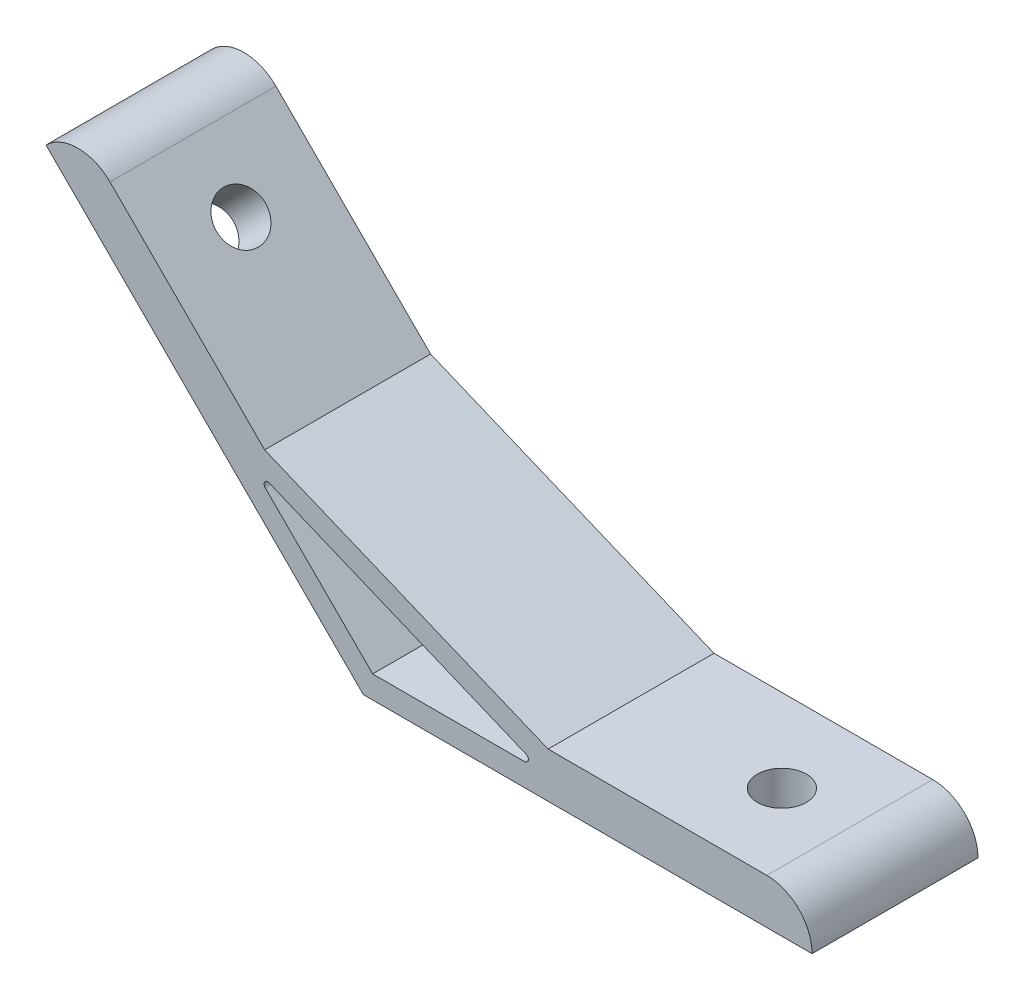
ISO-10303-21;
HEADER;
FILE_DESCRIPTION(('STEP AP214'),'2;1');
FILE_NAME('part.step','',(''),(''),'','','');
FILE_SCHEMA(('AUTOMOTIVE_DESIGN { 1 0 10303 214 1 1 1 1 }'));
ENDSEC;
DATA;
#1=APPLICATION_CONTEXT('core data for automotive mechanical design processes');
#2=APPLICATION_PROTOCOL_DEFINITION('international standard','automotive_design',2000,#1);
#3=PRODUCT_CONTEXT('',#1,'mechanical');
#4=PRODUCT('Part','Part','',(#3));
#5=PRODUCT_RELATED_PRODUCT_CATEGORY('part','',(#4));
#6=PRODUCT_DEFINITION_FORMATION('','',#4);
#7=PRODUCT_DEFINITION_CONTEXT('part definition',#1,'design');
#8=PRODUCT_DEFINITION('design','',#6,#7);
#9=PRODUCT_DEFINITION_SHAPE('','',#8);
#10=(LENGTH_UNIT() NAMED_UNIT(*) SI_UNIT(.MILLI.,.METRE.));
#11=(NAMED_UNIT(*) PLANE_ANGLE_UNIT() SI_UNIT($,.RADIAN.));
#12=(NAMED_UNIT(*) SI_UNIT($,.STERADIAN.) SOLID_ANGLE_UNIT());
#13=UNCERTAINTY_MEASURE_WITH_UNIT(LENGTH_MEASURE(1.E-05),#10,'distance_accuracy_value','');
#14=(GEOMETRIC_REPRESENTATION_CONTEXT(3) GLOBAL_UNCERTAINTY_ASSIGNED_CONTEXT((#13)) GLOBAL_UNIT_ASSIGNED_CONTEXT((#10,
#11,#12)) REPRESENTATION_CONTEXT('',''));
#15=CARTESIAN_POINT('',(0.,0.,0.));
#16=DIRECTION('',(0.,0.,1.));
#17=DIRECTION('',(1.,0.,0.));
#18=AXIS2_PLACEMENT_3D('',#15,#16,#17);
#19=CARTESIAN_POINT('',(0.,0.,11.));
#20=DIRECTION('',(0.,1.,0.));
#21=DIRECTION('',(0.,0.,1.));
#22=AXIS2_PLACEMENT_3D('',#19,#20,#21);
#23=PLANE('',#22);
#24=DIRECTION('',(1.,0.,0.));
#25=VECTOR('',#24,1.);
#26=CARTESIAN_POINT('',(0.,0.,-11.));
#27=LINE('',#26,#25);
#28=CARTESIAN_POINT('',(0.,0.,-11.));
#29=VERTEX_POINT('',#28);
#30=CARTESIAN_POINT('',(59.5,0.,-11.));
#31=VERTEX_POINT('',#30);
#32=EDGE_CURVE('E166',#29,#31,#27,.T.);
#33=ORIENTED_EDGE('',*,*,#32,.T.);
#34=DIRECTION('',(0.,0.,-1.));
#35=VECTOR('',#34,1.);
#36=CARTESIAN_POINT('',(59.5,0.,11.));
#37=LINE('',#36,#35);
#38=CARTESIAN_POINT('',(59.5,0.,11.));
#39=VERTEX_POINT('',#38);
#40=EDGE_CURVE('E183',#39,#31,#37,.T.);
#41=ORIENTED_EDGE('',*,*,#40,.F.);
#42=DIRECTION('',(1.,0.,0.));
#43=VECTOR('',#42,1.);
#44=CARTESIAN_POINT('',(0.,0.,11.));
#45=LINE('',#44,#43);
#46=CARTESIAN_POINT('',(0.,0.,11.));
#47=VERTEX_POINT('',#46);
#48=EDGE_CURVE('E153',#47,#39,#45,.T.);
#49=ORIENTED_EDGE('',*,*,#48,.F.);
#50=DIRECTION('',(0.,0.,-1.));
#51=VECTOR('',#50,1.);
#52=CARTESIAN_POINT('',(0.,0.,11.));
#53=LINE('',#52,#51);
#54=EDGE_CURVE('E186',#47,#29,#53,.T.);
#55=ORIENTED_EDGE('',*,*,#54,.T.);
#56=EDGE_LOOP('',(#33,#41,#49,#55));
#57=FACE_BOUND('',#56,.T.);
#58=CARTESIAN_POINT('',(44.5,0.,0.));
#59=DIRECTION('',(0.,1.,0.));
#60=DIRECTION('',(-1.,0.,0.));
#61=AXIS2_PLACEMENT_3D('',#58,#59,#60);
#62=CIRCLE('',#61,3.25);
#63=CARTESIAN_POINT('',(41.25,0.,0.));
#64=VERTEX_POINT('',#63);
#65=EDGE_CURVE('E211',#64,#64,#62,.T.);
#66=ORIENTED_EDGE('',*,*,#65,.T.);
#67=EDGE_LOOP('',(#66));
#68=FACE_BOUND('',#67,.T.);
#69=ADVANCED_FACE('F31',(#57,#68),#23,.F.);
#70=CARTESIAN_POINT('',(59.5,6.,11.));
#71=DIRECTION('',(0.,-1.,0.));
#72=DIRECTION('',(1.,0.,0.));
#73=AXIS2_PLACEMENT_3D('',#70,#71,#72);
#74=PLANE('',#73);
#75=DIRECTION('',(-1.,0.,0.));
#76=VECTOR('',#75,1.);
#77=CARTESIAN_POINT('',(59.5,6.,11.));
#78=LINE('',#77,#76);
#79=CARTESIAN_POINT('',(53.5,6.,11.));
#80=VERTEX_POINT('',#79);
#81=CARTESIAN_POINT('',(24.5,6.,11.));
#82=VERTEX_POINT('',#81);
#83=EDGE_CURVE('E156',#80,#82,#78,.T.);
#84=ORIENTED_EDGE('',*,*,#83,.F.);
#85=DIRECTION('',(0.,0.,-1.));
#86=VECTOR('',#85,1.);
#87=CARTESIAN_POINT('',(53.5,6.,11.));
#88=LINE('',#87,#86);
#89=CARTESIAN_POINT('',(53.5,6.,-11.));
#90=VERTEX_POINT('',#89);
#91=EDGE_CURVE('E207',#80,#90,#88,.T.);
#92=ORIENTED_EDGE('',*,*,#91,.T.);
#93=DIRECTION('',(-1.,0.,0.));
#94=VECTOR('',#93,1.);
#95=CARTESIAN_POINT('',(59.5,6.,-11.));
#96=LINE('',#95,#94);
#97=CARTESIAN_POINT('',(24.5,6.,-11.));
#98=VERTEX_POINT('',#97);
#99=EDGE_CURVE('E169',#90,#98,#96,.T.);
#100=ORIENTED_EDGE('',*,*,#99,.T.);
#101=DIRECTION('',(0.,0.,-1.));
#102=VECTOR('',#101,1.);
#103=CARTESIAN_POINT('',(24.5,6.,11.));
#104=LINE('',#103,#102);
#105=EDGE_CURVE('E180',#82,#98,#104,.T.);
#106=ORIENTED_EDGE('',*,*,#105,.F.);
#107=EDGE_LOOP('',(#84,#92,#100,#106));
#108=FACE_BOUND('',#107,.T.);
#109=CARTESIAN_POINT('',(44.5,5.99999999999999,0.));
#110=DIRECTION('',(0.,-1.,0.));
#111=DIRECTION('',(1.,0.,0.));
#112=AXIS2_PLACEMENT_3D('',#109,#110,#111);
#113=CIRCLE('',#112,3.25);
#114=CARTESIAN_POINT('',(47.75,5.99999999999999,0.));
#115=VERTEX_POINT('',#114);
#116=EDGE_CURVE('E208',#115,#115,#113,.F.);
#117=ORIENTED_EDGE('',*,*,#116,.F.);
#118=EDGE_LOOP('',(#117));
#119=FACE_BOUND('',#118,.T.);
#120=ADVANCED_FACE('F245',(#108,#119),#74,.F.);
#121=CARTESIAN_POINT('',(0.,0.,11.));
#122=DIRECTION('',(0.707106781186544,0.707106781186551,0.));
#123=DIRECTION('',(-0.707106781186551,0.707106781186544,0.));
#124=AXIS2_PLACEMENT_3D('',#121,#122,#123);
#125=PLANE('',#124);
#126=CARTESIAN_POINT('',(-31.4662517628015,31.4662517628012,0.));
#127=DIRECTION('',(-0.707106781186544,-0.707106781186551,0.));
#128=DIRECTION('',(0.707106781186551,-0.707106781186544,0.));
#129=AXIS2_PLACEMENT_3D('',#126,#127,#128);
#130=CIRCLE('',#129,3.25);
#131=CARTESIAN_POINT('',(-29.1681547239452,29.1681547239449,0.));
#132=VERTEX_POINT('',#131);
#133=EDGE_CURVE('E201',#132,#132,#130,.T.);
#134=ORIENTED_EDGE('',*,*,#133,.F.);
#135=EDGE_LOOP('',(#134));
#136=FACE_BOUND('',#135,.T.);
#137=DIRECTION('',(0.707106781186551,-0.707106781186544,0.));
#138=VECTOR('',#137,1.);
#139=CARTESIAN_POINT('',(0.,0.,-11.));
#140=LINE('',#139,#138);
#141=CARTESIAN_POINT('',(-42.0728534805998,42.0728534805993,-11.));
#142=VERTEX_POINT('',#141);
#143=EDGE_CURVE('E137',#142,#29,#140,.T.);
#144=ORIENTED_EDGE('',*,*,#143,.T.);
#145=ORIENTED_EDGE('',*,*,#54,.F.);
#146=DIRECTION('',(0.707106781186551,-0.707106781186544,0.));
#147=VECTOR('',#146,1.);
#148=CARTESIAN_POINT('',(0.,0.,11.));
#149=LINE('',#148,#147);
#150=CARTESIAN_POINT('',(-42.0728534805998,42.0728534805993,11.));
#151=VERTEX_POINT('',#150);
#152=EDGE_CURVE('E150',#151,#47,#149,.T.);
#153=ORIENTED_EDGE('',*,*,#152,.F.);
#154=DIRECTION('',(0.,0.,-1.));
#155=VECTOR('',#154,1.);
#156=CARTESIAN_POINT('',(-42.0728534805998,42.0728534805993,11.));
#157=LINE('',#156,#155);
#158=EDGE_CURVE('E163',#151,#142,#157,.T.);
#159=ORIENTED_EDGE('',*,*,#158,.T.);
#160=EDGE_LOOP('',(#144,#145,#153,#159));
#161=FACE_BOUND('',#160,.T.);
#162=ADVANCED_FACE('F251',(#136,#161),#125,.F.);
#163=CARTESIAN_POINT('',(-13.0814754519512,21.5667568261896,11.));
#164=DIRECTION('',(-0.382683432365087,-0.923879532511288,0.));
#165=DIRECTION('',(0.923879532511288,-0.382683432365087,0.));
#166=AXIS2_PLACEMENT_3D('',#163,#164,#165);
#167=PLANE('',#166);
#168=DIRECTION('',(-0.923879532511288,0.382683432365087,0.));
#169=VECTOR('',#168,1.);
#170=CARTESIAN_POINT('',(-13.0814754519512,21.5667568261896,-11.));
#171=LINE('',#170,#169);
#172=CARTESIAN_POINT('',(-13.0814754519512,21.5667568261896,-11.));
#173=VERTEX_POINT('',#172);
#174=EDGE_CURVE('E171',#98,#173,#171,.T.);
#175=ORIENTED_EDGE('',*,*,#174,.T.);
#176=DIRECTION('',(0.,0.,-1.));
#177=VECTOR('',#176,1.);
#178=CARTESIAN_POINT('',(-13.0814754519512,21.5667568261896,11.));
#179=LINE('',#178,#177);
#180=CARTESIAN_POINT('',(-13.0814754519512,21.5667568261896,11.));
#181=VERTEX_POINT('',#180);
#182=EDGE_CURVE('E177',#181,#173,#179,.T.);
#183=ORIENTED_EDGE('',*,*,#182,.F.);
#184=DIRECTION('',(-0.923879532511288,0.382683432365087,0.));
#185=VECTOR('',#184,1.);
#186=CARTESIAN_POINT('',(-13.0814754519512,21.5667568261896,11.));
#187=LINE('',#186,#185);
#188=EDGE_CURVE('E158',#82,#181,#187,.T.);
#189=ORIENTED_EDGE('',*,*,#188,.F.);
#190=ORIENTED_EDGE('',*,*,#105,.T.);
#191=EDGE_LOOP('',(#175,#183,#189,#190));
#192=FACE_BOUND('',#191,.T.);
#193=ADVANCED_FACE('F257',(#192),#167,.F.);
#194=CARTESIAN_POINT('',(-37.8302127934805,46.3154941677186,11.));
#195=DIRECTION('',(-0.707106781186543,-0.707106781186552,0.));
#196=DIRECTION('',(0.707106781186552,-0.707106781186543,0.));
#197=AXIS2_PLACEMENT_3D('',#194,#195,#196);
#198=PLANE('',#197);
#199=CARTESIAN_POINT('',(-27.2236110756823,35.7088924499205,0.));
#200=DIRECTION('',(-0.707106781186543,-0.707106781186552,0.));
#201=DIRECTION('',(0.707106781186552,-0.707106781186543,0.));
#202=AXIS2_PLACEMENT_3D('',#199,#200,#201);
#203=CIRCLE('',#202,3.25);
#204=CARTESIAN_POINT('',(-24.925514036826,33.4107954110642,0.));
#205=VERTEX_POINT('',#204);
#206=EDGE_CURVE('E147',#205,#205,#203,.T.);
#207=ORIENTED_EDGE('',*,*,#206,.T.);
#208=EDGE_LOOP('',(#207));
#209=FACE_BOUND('',#208,.T.);
#210=DIRECTION('',(-0.707106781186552,0.707106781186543,0.));
#211=VECTOR('',#210,1.);
#212=CARTESIAN_POINT('',(-37.8302127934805,46.3154941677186,-11.));
#213=LINE('',#212,#211);
#214=CARTESIAN_POINT('',(-33.5875721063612,42.0728534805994,-11.));
#215=VERTEX_POINT('',#214);
#216=EDGE_CURVE('E154',#173,#215,#213,.T.);
#217=ORIENTED_EDGE('',*,*,#216,.T.);
#218=DIRECTION('',(0.,0.,-1.));
#219=VECTOR('',#218,1.);
#220=CARTESIAN_POINT('',(-33.5875721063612,42.0728534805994,11.));
#221=LINE('',#220,#219);
#222=CARTESIAN_POINT('',(-33.5875721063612,42.0728534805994,11.));
#223=VERTEX_POINT('',#222);
#224=EDGE_CURVE('E203',#215,#223,#221,.F.);
#225=ORIENTED_EDGE('',*,*,#224,.T.);
#226=DIRECTION('',(-0.707106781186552,0.707106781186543,0.));
#227=VECTOR('',#226,1.);
#228=CARTESIAN_POINT('',(-37.8302127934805,46.3154941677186,11.));
#229=LINE('',#228,#227);
#230=EDGE_CURVE('E160',#181,#223,#229,.T.);
#231=ORIENTED_EDGE('',*,*,#230,.F.);
#232=ORIENTED_EDGE('',*,*,#182,.T.);
#233=EDGE_LOOP('',(#217,#225,#231,#232));
#234=FACE_BOUND('',#233,.T.);
#235=ADVANCED_FACE('F262',(#209,#234),#198,.F.);
#236=CARTESIAN_POINT('',(-42.0728534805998,42.0728534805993,11.));
#237=DIRECTION('',(0.,0.,-1.));
#238=DIRECTION('',(-1.,0.,0.));
#239=AXIS2_PLACEMENT_3D('',#236,#237,#238);
#240=PLANE('',#239);
#241=DIRECTION('',(1.,0.,0.));
#242=VECTOR('',#241,1.);
#243=CARTESIAN_POINT('',(1.24264068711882,3.,11.));
#244=LINE('',#243,#242);
#245=CARTESIAN_POINT('',(1.24264068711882,3.,11.));
#246=VERTEX_POINT('',#245);
#247=CARTESIAN_POINT('',(21.3895931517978,3.,11.));
#248=VERTEX_POINT('',#247);
#249=EDGE_CURVE('E146',#246,#248,#244,.T.);
#250=ORIENTED_EDGE('',*,*,#249,.F.);
#251=DIRECTION('',(0.707106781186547,-0.707106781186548,0.));
#252=VECTOR('',#251,1.);
#253=CARTESIAN_POINT('',(-14.7808389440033,19.0234796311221,11.));
#254=LINE('',#253,#252);
#255=CARTESIAN_POINT('',(-13.0034060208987,17.2460467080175,11.));
#256=VERTEX_POINT('',#255);
#257=EDGE_CURVE('E136',#256,#246,#254,.T.);
#258=ORIENTED_EDGE('',*,*,#257,.F.);
#259=CARTESIAN_POINT('',(-12.6498526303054,17.5996000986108,11.));
#260=DIRECTION('',(0.,0.,-1.));
#261=DIRECTION('',(-1.,0.,0.));
#262=AXIS2_PLACEMENT_3D('',#259,#260,#261);
#263=CIRCLE('',#262,0.5);
#264=CARTESIAN_POINT('',(-12.4585109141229,18.0615398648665,11.));
#265=VERTEX_POINT('',#264);
#266=EDGE_CURVE('E194',#256,#265,#263,.T.);
#267=ORIENTED_EDGE('',*,*,#266,.T.);
#268=DIRECTION('',(-0.923879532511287,0.38268343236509,0.));
#269=VECTOR('',#268,1.);
#270=CARTESIAN_POINT('',(-14.7808389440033,19.0234796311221,11.));
#271=LINE('',#270,#269);
#272=CARTESIAN_POINT('',(21.5809348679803,3.96193976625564,11.));
#273=VERTEX_POINT('',#272);
#274=EDGE_CURVE('E130',#273,#265,#271,.T.);
#275=ORIENTED_EDGE('',*,*,#274,.F.);
#276=CARTESIAN_POINT('',(21.3895931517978,3.5,11.));
#277=DIRECTION('',(0.,0.,-1.));
#278=DIRECTION('',(-1.,0.,0.));
#279=AXIS2_PLACEMENT_3D('',#276,#277,#278);
#280=CIRCLE('',#279,0.5);
#281=EDGE_CURVE('E39',#273,#248,#280,.T.);
#282=ORIENTED_EDGE('',*,*,#281,.T.);
#283=EDGE_LOOP('',(#250,#258,#267,#275,#282));
#284=FACE_BOUND('',#283,.T.);
#285=ORIENTED_EDGE('',*,*,#48,.T.);
#286=CARTESIAN_POINT('',(53.5,0.,11.));
#287=DIRECTION('',(0.,0.,-1.));
#288=DIRECTION('',(-1.,0.,0.));
#289=AXIS2_PLACEMENT_3D('',#286,#287,#288);
#290=CIRCLE('',#289,6.);
#291=EDGE_CURVE('E216',#39,#80,#290,.F.);
#292=ORIENTED_EDGE('',*,*,#291,.T.);
#293=ORIENTED_EDGE('',*,*,#83,.T.);
#294=ORIENTED_EDGE('',*,*,#188,.T.);
#295=ORIENTED_EDGE('',*,*,#230,.T.);
#296=CARTESIAN_POINT('',(-37.8302127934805,37.8302127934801,11.));
#297=DIRECTION('',(0.,0.,-1.));
#298=DIRECTION('',(-1.,0.,0.));
#299=AXIS2_PLACEMENT_3D('',#296,#297,#298);
#300=CIRCLE('',#299,6.);
#301=EDGE_CURVE('E205',#223,#151,#300,.F.);
#302=ORIENTED_EDGE('',*,*,#301,.T.);
#303=ORIENTED_EDGE('',*,*,#152,.T.);
#304=EDGE_LOOP('',(#285,#292,#293,#294,#295,#302,#303));
#305=FACE_BOUND('',#304,.T.);
#306=ADVANCED_FACE('F226',(#284,#305),#240,.F.);
#307=CARTESIAN_POINT('',(-42.0728534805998,42.0728534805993,-11.));
#308=DIRECTION('',(0.,0.,-1.));
#309=DIRECTION('',(-1.,0.,0.));
#310=AXIS2_PLACEMENT_3D('',#307,#308,#309);
#311=PLANE('',#310);
#312=DIRECTION('',(1.,0.,0.));
#313=VECTOR('',#312,1.);
#314=CARTESIAN_POINT('',(1.24264068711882,3.,-11.));
#315=LINE('',#314,#313);
#316=CARTESIAN_POINT('',(1.24264068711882,3.,-11.));
#317=VERTEX_POINT('',#316);
#318=CARTESIAN_POINT('',(21.3895931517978,3.,-11.));
#319=VERTEX_POINT('',#318);
#320=EDGE_CURVE('E123',#317,#319,#315,.T.);
#321=ORIENTED_EDGE('',*,*,#320,.T.);
#322=CARTESIAN_POINT('',(21.3895931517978,3.5,-11.));
#323=DIRECTION('',(0.,0.,-1.));
#324=DIRECTION('',(-1.,0.,0.));
#325=AXIS2_PLACEMENT_3D('',#322,#323,#324);
#326=CIRCLE('',#325,0.5);
#327=CARTESIAN_POINT('',(21.5809348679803,3.96193976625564,-11.));
#328=VERTEX_POINT('',#327);
#329=EDGE_CURVE('E11',#319,#328,#326,.F.);
#330=ORIENTED_EDGE('',*,*,#329,.T.);
#331=DIRECTION('',(-0.923879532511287,0.38268343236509,0.));
#332=VECTOR('',#331,1.);
#333=CARTESIAN_POINT('',(-14.7808389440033,19.0234796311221,-11.));
#334=LINE('',#333,#332);
#335=CARTESIAN_POINT('',(-12.4585109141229,18.0615398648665,-11.));
#336=VERTEX_POINT('',#335);
#337=EDGE_CURVE('E138',#328,#336,#334,.T.);
#338=ORIENTED_EDGE('',*,*,#337,.T.);
#339=CARTESIAN_POINT('',(-12.6498526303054,17.5996000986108,-11.));
#340=DIRECTION('',(0.,0.,-1.));
#341=DIRECTION('',(-1.,0.,0.));
#342=AXIS2_PLACEMENT_3D('',#339,#340,#341);
#343=CIRCLE('',#342,0.5);
#344=CARTESIAN_POINT('',(-13.0034060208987,17.2460467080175,-11.));
#345=VERTEX_POINT('',#344);
#346=EDGE_CURVE('E126',#336,#345,#343,.F.);
#347=ORIENTED_EDGE('',*,*,#346,.T.);
#348=DIRECTION('',(0.707106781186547,-0.707106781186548,0.));
#349=VECTOR('',#348,1.);
#350=CARTESIAN_POINT('',(-14.7808389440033,19.0234796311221,-11.));
#351=LINE('',#350,#349);
#352=EDGE_CURVE('E119',#345,#317,#351,.T.);
#353=ORIENTED_EDGE('',*,*,#352,.T.);
#354=EDGE_LOOP('',(#321,#330,#338,#347,#353));
#355=FACE_BOUND('',#354,.T.);
#356=ORIENTED_EDGE('',*,*,#99,.F.);
#357=CARTESIAN_POINT('',(53.5,0.,-11.));
#358=DIRECTION('',(0.,0.,-1.));
#359=DIRECTION('',(-1.,0.,0.));
#360=AXIS2_PLACEMENT_3D('',#357,#358,#359);
#361=CIRCLE('',#360,6.);
#362=EDGE_CURVE('E214',#90,#31,#361,.T.);
#363=ORIENTED_EDGE('',*,*,#362,.T.);
#364=ORIENTED_EDGE('',*,*,#32,.F.);
#365=ORIENTED_EDGE('',*,*,#143,.F.);
#366=CARTESIAN_POINT('',(-37.8302127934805,37.8302127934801,-11.));
#367=DIRECTION('',(0.,0.,-1.));
#368=DIRECTION('',(-1.,0.,0.));
#369=AXIS2_PLACEMENT_3D('',#366,#367,#368);
#370=CIRCLE('',#369,6.);
#371=EDGE_CURVE('E198',#142,#215,#370,.T.);
#372=ORIENTED_EDGE('',*,*,#371,.T.);
#373=ORIENTED_EDGE('',*,*,#216,.F.);
#374=ORIENTED_EDGE('',*,*,#174,.F.);
#375=EDGE_LOOP('',(#356,#363,#364,#365,#372,#373,#374));
#376=FACE_BOUND('',#375,.T.);
#377=ADVANCED_FACE('F121',(#355,#376),#311,.T.);
#378=CARTESIAN_POINT('',(-14.7808389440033,19.0234796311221,-11.));
#379=DIRECTION('',(-0.707106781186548,-0.707106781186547,0.));
#380=DIRECTION('',(0.707106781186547,-0.707106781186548,0.));
#381=AXIS2_PLACEMENT_3D('',#378,#379,#380);
#382=PLANE('',#381);
#383=ORIENTED_EDGE('',*,*,#352,.F.);
#384=DIRECTION('',(0.,0.,1.));
#385=VECTOR('',#384,1.);
#386=CARTESIAN_POINT('',(-13.0034060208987,17.2460467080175,11.));
#387=LINE('',#386,#385);
#388=EDGE_CURVE('E189',#345,#256,#387,.T.);
#389=ORIENTED_EDGE('',*,*,#388,.T.);
#390=ORIENTED_EDGE('',*,*,#257,.T.);
#391=DIRECTION('',(0.,0.,1.));
#392=VECTOR('',#391,1.);
#393=CARTESIAN_POINT('',(1.24264068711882,3.,-11.));
#394=LINE('',#393,#392);
#395=EDGE_CURVE('E133',#317,#246,#394,.T.);
#396=ORIENTED_EDGE('',*,*,#395,.F.);
#397=EDGE_LOOP('',(#383,#389,#390,#396));
#398=FACE_BOUND('',#397,.T.);
#399=ADVANCED_FACE('F134',(#398),#382,.F.);
#400=CARTESIAN_POINT('',(-14.7808389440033,19.0234796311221,-11.));
#401=DIRECTION('',(0.38268343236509,0.923879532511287,0.));
#402=DIRECTION('',(-0.923879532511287,0.38268343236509,0.));
#403=AXIS2_PLACEMENT_3D('',#400,#401,#402);
#404=PLANE('',#403);
#405=ORIENTED_EDGE('',*,*,#337,.F.);
#406=DIRECTION('',(0.,0.,1.));
#407=VECTOR('',#406,1.);
#408=CARTESIAN_POINT('',(21.5809348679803,3.96193976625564,11.));
#409=LINE('',#408,#407);
#410=EDGE_CURVE('E218',#328,#273,#409,.T.);
#411=ORIENTED_EDGE('',*,*,#410,.T.);
#412=ORIENTED_EDGE('',*,*,#274,.T.);
#413=DIRECTION('',(0.,0.,1.));
#414=VECTOR('',#413,1.);
#415=CARTESIAN_POINT('',(-12.4585109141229,18.0615398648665,-11.));
#416=LINE('',#415,#414);
#417=EDGE_CURVE('E191',#265,#336,#416,.F.);
#418=ORIENTED_EDGE('',*,*,#417,.T.);
#419=EDGE_LOOP('',(#405,#411,#412,#418));
#420=FACE_BOUND('',#419,.T.);
#421=ADVANCED_FACE('F224',(#420),#404,.F.);
#422=CARTESIAN_POINT('',(1.24264068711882,3.,-11.));
#423=DIRECTION('',(0.,-1.,0.));
#424=DIRECTION('',(0.,0.,-1.));
#425=AXIS2_PLACEMENT_3D('',#422,#423,#424);
#426=PLANE('',#425);
#427=ORIENTED_EDGE('',*,*,#249,.T.);
#428=DIRECTION('',(0.,0.,1.));
#429=VECTOR('',#428,1.);
#430=CARTESIAN_POINT('',(21.3895931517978,3.,-11.));
#431=LINE('',#430,#429);
#432=EDGE_CURVE('E46',#248,#319,#431,.F.);
#433=ORIENTED_EDGE('',*,*,#432,.T.);
#434=ORIENTED_EDGE('',*,*,#320,.F.);
#435=ORIENTED_EDGE('',*,*,#395,.T.);
#436=EDGE_LOOP('',(#427,#433,#434,#435));
#437=FACE_BOUND('',#436,.T.);
#438=ADVANCED_FACE('F140',(#437),#426,.F.);
#439=CARTESIAN_POINT('',(-12.6498526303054,17.5996000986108,-11.));
#440=DIRECTION('',(0.,0.,-1.));
#441=DIRECTION('',(-1.,0.,0.));
#442=AXIS2_PLACEMENT_3D('',#439,#440,#441);
#443=CYLINDRICAL_SURFACE('',#442,0.5);
#444=ORIENTED_EDGE('',*,*,#346,.F.);
#445=ORIENTED_EDGE('',*,*,#417,.F.);
#446=ORIENTED_EDGE('',*,*,#266,.F.);
#447=ORIENTED_EDGE('',*,*,#388,.F.);
#448=EDGE_LOOP('',(#444,#445,#446,#447));
#449=FACE_BOUND('',#448,.T.);
#450=ADVANCED_FACE('F230',(#449),#443,.F.);
#451=CARTESIAN_POINT('',(-8.83883476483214,54.0936687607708,0.));
#452=DIRECTION('',(-0.707106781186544,-0.707106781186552,0.));
#453=DIRECTION('',(0.707106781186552,-0.707106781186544,0.));
#454=AXIS2_PLACEMENT_3D('',#451,#452,#453);
#455=CYLINDRICAL_SURFACE('',#454,3.25);
#456=ORIENTED_EDGE('',*,*,#133,.T.);
#457=EDGE_LOOP('',(#456));
#458=FACE_BOUND('',#457,.T.);
#459=ORIENTED_EDGE('',*,*,#206,.F.);
#460=EDGE_LOOP('',(#459));
#461=FACE_BOUND('',#460,.T.);
#462=ADVANCED_FACE('F232',(#458,#461),#455,.F.);
#463=CARTESIAN_POINT('',(-37.8302127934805,37.8302127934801,11.));
#464=DIRECTION('',(0.,0.,-1.));
#465=DIRECTION('',(-1.,0.,0.));
#466=AXIS2_PLACEMENT_3D('',#463,#464,#465);
#467=CYLINDRICAL_SURFACE('',#466,6.);
#468=ORIENTED_EDGE('',*,*,#301,.F.);
#469=ORIENTED_EDGE('',*,*,#224,.F.);
#470=ORIENTED_EDGE('',*,*,#371,.F.);
#471=ORIENTED_EDGE('',*,*,#158,.F.);
#472=EDGE_LOOP('',(#468,#469,#470,#471));
#473=FACE_BOUND('',#472,.T.);
#474=ADVANCED_FACE('F238',(#473),#467,.T.);
#475=CARTESIAN_POINT('',(44.5000000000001,31.9999999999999,0.));
#476=DIRECTION('',(0.,-1.,0.));
#477=DIRECTION('',(1.,0.,0.));
#478=AXIS2_PLACEMENT_3D('',#475,#476,#477);
#479=CYLINDRICAL_SURFACE('',#478,3.25);
#480=ORIENTED_EDGE('',*,*,#65,.F.);
#481=EDGE_LOOP('',(#480));
#482=FACE_BOUND('',#481,.T.);
#483=ORIENTED_EDGE('',*,*,#116,.T.);
#484=EDGE_LOOP('',(#483));
#485=FACE_BOUND('',#484,.T.);
#486=ADVANCED_FACE('F290',(#482,#485),#479,.F.);
#487=CARTESIAN_POINT('',(53.5,0.,11.));
#488=DIRECTION('',(0.,0.,-1.));
#489=DIRECTION('',(-1.,0.,0.));
#490=AXIS2_PLACEMENT_3D('',#487,#488,#489);
#491=CYLINDRICAL_SURFACE('',#490,6.);
#492=ORIENTED_EDGE('',*,*,#291,.F.);
#493=ORIENTED_EDGE('',*,*,#40,.T.);
#494=ORIENTED_EDGE('',*,*,#362,.F.);
#495=ORIENTED_EDGE('',*,*,#91,.F.);
#496=EDGE_LOOP('',(#492,#493,#494,#495));
#497=FACE_BOUND('',#496,.T.);
#498=ADVANCED_FACE('F288',(#497),#491,.T.);
#499=CARTESIAN_POINT('',(21.3895931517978,3.5,-11.));
#500=DIRECTION('',(0.,0.,-1.));
#501=DIRECTION('',(-1.,0.,0.));
#502=AXIS2_PLACEMENT_3D('',#499,#500,#501);
#503=CYLINDRICAL_SURFACE('',#502,0.5);
#504=ORIENTED_EDGE('',*,*,#329,.F.);
#505=ORIENTED_EDGE('',*,*,#432,.F.);
#506=ORIENTED_EDGE('',*,*,#281,.F.);
#507=ORIENTED_EDGE('',*,*,#410,.F.);
#508=EDGE_LOOP('',(#504,#505,#506,#507));
#509=FACE_BOUND('',#508,.T.);
#510=ADVANCED_FACE('F33',(#509),#503,.F.);
#511=CLOSED_SHELL('',(#69,#120,#162,#193,#235,#306,#377,#399,#421,#438,#450,#462,#474,#486,#498,#510));
#512=MANIFOLD_SOLID_BREP('B2',#511);
#513=ADVANCED_BREP_SHAPE_REPRESENTATION('',(#18,#512),#14);
#514=SHAPE_DEFINITION_REPRESENTATION(#9,#513);
ENDSEC;
END-ISO-10303-21;
